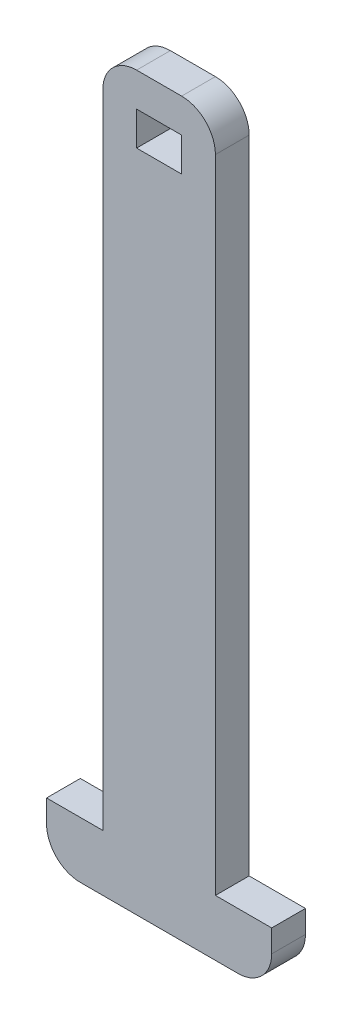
ISO-10303-21;
HEADER;
FILE_DESCRIPTION(('STEP AP214'),'2;1');
FILE_NAME('part.step','',(''),(''),'','','');
FILE_SCHEMA(('AUTOMOTIVE_DESIGN { 1 0 10303 214 1 1 1 1 }'));
ENDSEC;
DATA;
#1=APPLICATION_CONTEXT('core data for automotive mechanical design processes');
#2=APPLICATION_PROTOCOL_DEFINITION('international standard','automotive_design',2000,#1);
#3=PRODUCT_CONTEXT('',#1,'mechanical');
#4=PRODUCT('Part','Part','',(#3));
#5=PRODUCT_RELATED_PRODUCT_CATEGORY('part','',(#4));
#6=PRODUCT_DEFINITION_FORMATION('','',#4);
#7=PRODUCT_DEFINITION_CONTEXT('part definition',#1,'design');
#8=PRODUCT_DEFINITION('design','',#6,#7);
#9=PRODUCT_DEFINITION_SHAPE('','',#8);
#10=(LENGTH_UNIT() NAMED_UNIT(*) SI_UNIT(.MILLI.,.METRE.));
#11=(NAMED_UNIT(*) PLANE_ANGLE_UNIT() SI_UNIT($,.RADIAN.));
#12=(NAMED_UNIT(*) SI_UNIT($,.STERADIAN.) SOLID_ANGLE_UNIT());
#13=UNCERTAINTY_MEASURE_WITH_UNIT(LENGTH_MEASURE(1.E-05),#10,'distance_accuracy_value','');
#14=(GEOMETRIC_REPRESENTATION_CONTEXT(3) GLOBAL_UNCERTAINTY_ASSIGNED_CONTEXT((#13)) GLOBAL_UNIT_ASSIGNED_CONTEXT((#10,
#11,#12)) REPRESENTATION_CONTEXT('',''));
#15=CARTESIAN_POINT('',(0.,0.,0.));
#16=DIRECTION('',(0.,0.,1.));
#17=DIRECTION('',(1.,0.,0.));
#18=AXIS2_PLACEMENT_3D('',#15,#16,#17);
#19=CARTESIAN_POINT('',(0.,0.,3.));
#20=DIRECTION('',(0.,0.,1.));
#21=DIRECTION('',(1.,0.,0.));
#22=AXIS2_PLACEMENT_3D('',#19,#20,#21);
#23=PLANE('',#22);
#24=DIRECTION('',(0.,-1.,0.));
#25=VECTOR('',#24,1.);
#26=CARTESIAN_POINT('',(-5.,-38.8970588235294,3.));
#27=LINE('',#26,#25);
#28=CARTESIAN_POINT('',(-5.,-38.8970588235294,3.));
#29=VERTEX_POINT('',#28);
#30=CARTESIAN_POINT('',(-5.,-40.8970588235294,3.));
#31=VERTEX_POINT('',#30);
#32=EDGE_CURVE('E198',#29,#31,#27,.T.);
#33=ORIENTED_EDGE('',*,*,#32,.T.);
#34=CARTESIAN_POINT('',(-2.,-40.8970588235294,3.));
#35=DIRECTION('',(0.,0.,1.));
#36=DIRECTION('',(1.,0.,0.));
#37=AXIS2_PLACEMENT_3D('',#34,#35,#36);
#38=CIRCLE('',#37,3.);
#39=CARTESIAN_POINT('',(-2.,-43.8970588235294,3.));
#40=VERTEX_POINT('',#39);
#41=EDGE_CURVE('E258',#31,#40,#38,.T.);
#42=ORIENTED_EDGE('',*,*,#41,.T.);
#43=DIRECTION('',(1.,0.,0.));
#44=VECTOR('',#43,1.);
#45=CARTESIAN_POINT('',(-4.99999999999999,-43.8970588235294,3.));
#46=LINE('',#45,#44);
#47=CARTESIAN_POINT('',(12.,-43.8970588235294,3.));
#48=VERTEX_POINT('',#47);
#49=EDGE_CURVE('E201',#40,#48,#46,.T.);
#50=ORIENTED_EDGE('',*,*,#49,.T.);
#51=CARTESIAN_POINT('',(12.,-40.8970588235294,3.));
#52=DIRECTION('',(0.,0.,1.));
#53=DIRECTION('',(1.,0.,0.));
#54=AXIS2_PLACEMENT_3D('',#51,#52,#53);
#55=CIRCLE('',#54,3.);
#56=CARTESIAN_POINT('',(15.,-40.8970588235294,3.));
#57=VERTEX_POINT('',#56);
#58=EDGE_CURVE('E55',#48,#57,#55,.T.);
#59=ORIENTED_EDGE('',*,*,#58,.T.);
#60=DIRECTION('',(0.,1.,0.));
#61=VECTOR('',#60,1.);
#62=CARTESIAN_POINT('',(15.,-43.8970588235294,3.));
#63=LINE('',#62,#61);
#64=CARTESIAN_POINT('',(15.,-38.8970588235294,3.));
#65=VERTEX_POINT('',#64);
#66=EDGE_CURVE('E203',#57,#65,#63,.T.);
#67=ORIENTED_EDGE('',*,*,#66,.T.);
#68=DIRECTION('',(-1.,0.,0.));
#69=VECTOR('',#68,1.);
#70=CARTESIAN_POINT('',(15.,-38.8970588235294,3.));
#71=LINE('',#70,#69);
#72=CARTESIAN_POINT('',(9.99999999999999,-38.8970588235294,3.));
#73=VERTEX_POINT('',#72);
#74=EDGE_CURVE('E205',#65,#73,#71,.T.);
#75=ORIENTED_EDGE('',*,*,#74,.T.);
#76=DIRECTION('',(0.,1.,0.));
#77=VECTOR('',#76,1.);
#78=CARTESIAN_POINT('',(9.99999999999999,-38.8970588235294,3.));
#79=LINE('',#78,#77);
#80=CARTESIAN_POINT('',(9.99999999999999,18.1029411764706,3.));
#81=VERTEX_POINT('',#80);
#82=EDGE_CURVE('E207',#73,#81,#79,.T.);
#83=ORIENTED_EDGE('',*,*,#82,.T.);
#84=CARTESIAN_POINT('',(6.99999999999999,18.1029411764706,3.));
#85=DIRECTION('',(0.,0.,1.));
#86=DIRECTION('',(1.,0.,0.));
#87=AXIS2_PLACEMENT_3D('',#84,#85,#86);
#88=CIRCLE('',#87,3.);
#89=CARTESIAN_POINT('',(6.99999999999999,21.1029411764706,3.));
#90=VERTEX_POINT('',#89);
#91=EDGE_CURVE('E255',#81,#90,#88,.T.);
#92=ORIENTED_EDGE('',*,*,#91,.T.);
#93=DIRECTION('',(-1.,0.,0.));
#94=VECTOR('',#93,1.);
#95=CARTESIAN_POINT('',(9.99999999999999,21.1029411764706,3.));
#96=LINE('',#95,#94);
#97=CARTESIAN_POINT('',(2.99999999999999,21.1029411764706,3.));
#98=VERTEX_POINT('',#97);
#99=EDGE_CURVE('E190',#90,#98,#96,.T.);
#100=ORIENTED_EDGE('',*,*,#99,.T.);
#101=CARTESIAN_POINT('',(2.99999999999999,18.1029411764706,3.));
#102=DIRECTION('',(0.,0.,1.));
#103=DIRECTION('',(1.,0.,0.));
#104=AXIS2_PLACEMENT_3D('',#101,#102,#103);
#105=CIRCLE('',#104,3.);
#106=CARTESIAN_POINT('',(0.,18.1029411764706,3.));
#107=VERTEX_POINT('',#106);
#108=EDGE_CURVE('E253',#98,#107,#105,.T.);
#109=ORIENTED_EDGE('',*,*,#108,.T.);
#110=DIRECTION('',(0.,-1.,0.));
#111=VECTOR('',#110,1.);
#112=CARTESIAN_POINT('',(0.,21.1029411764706,3.));
#113=LINE('',#112,#111);
#114=CARTESIAN_POINT('',(0.,-38.8970588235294,3.));
#115=VERTEX_POINT('',#114);
#116=EDGE_CURVE('E193',#107,#115,#113,.T.);
#117=ORIENTED_EDGE('',*,*,#116,.T.);
#118=DIRECTION('',(-1.,0.,0.));
#119=VECTOR('',#118,1.);
#120=CARTESIAN_POINT('',(0.,-38.8970588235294,3.));
#121=LINE('',#120,#119);
#122=EDGE_CURVE('E196',#115,#29,#121,.T.);
#123=ORIENTED_EDGE('',*,*,#122,.T.);
#124=EDGE_LOOP('',(#33,#42,#50,#59,#67,#75,#83,#92,#100,#109,#117,#123));
#125=FACE_BOUND('',#124,.T.);
#126=DIRECTION('',(0.,-1.,0.));
#127=VECTOR('',#126,1.);
#128=CARTESIAN_POINT('',(2.99999999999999,18.1029411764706,3.));
#129=LINE('',#128,#127);
#130=CARTESIAN_POINT('',(2.99999999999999,18.1029411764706,3.));
#131=VERTEX_POINT('',#130);
#132=CARTESIAN_POINT('',(2.99999999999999,15.1029411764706,3.));
#133=VERTEX_POINT('',#132);
#134=EDGE_CURVE('E159',#131,#133,#129,.T.);
#135=ORIENTED_EDGE('',*,*,#134,.F.);
#136=DIRECTION('',(-1.,0.,0.));
#137=VECTOR('',#136,1.);
#138=CARTESIAN_POINT('',(6.99999999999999,18.1029411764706,3.));
#139=LINE('',#138,#137);
#140=CARTESIAN_POINT('',(6.99999999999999,18.1029411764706,3.));
#141=VERTEX_POINT('',#140);
#142=EDGE_CURVE('E149',#141,#131,#139,.T.);
#143=ORIENTED_EDGE('',*,*,#142,.F.);
#144=DIRECTION('',(0.,1.,0.));
#145=VECTOR('',#144,1.);
#146=CARTESIAN_POINT('',(6.99999999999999,15.1029411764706,3.));
#147=LINE('',#146,#145);
#148=CARTESIAN_POINT('',(6.99999999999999,15.1029411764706,3.));
#149=VERTEX_POINT('',#148);
#150=EDGE_CURVE('E174',#149,#141,#147,.T.);
#151=ORIENTED_EDGE('',*,*,#150,.F.);
#152=DIRECTION('',(1.,0.,0.));
#153=VECTOR('',#152,1.);
#154=CARTESIAN_POINT('',(2.99999999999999,15.1029411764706,3.));
#155=LINE('',#154,#153);
#156=EDGE_CURVE('E172',#133,#149,#155,.T.);
#157=ORIENTED_EDGE('',*,*,#156,.F.);
#158=EDGE_LOOP('',(#135,#143,#151,#157));
#159=FACE_BOUND('',#158,.T.);
#160=ADVANCED_FACE('F33',(#125,#159),#23,.T.);
#161=CARTESIAN_POINT('',(0.,0.,0.));
#162=DIRECTION('',(0.,0.,1.));
#163=DIRECTION('',(1.,0.,0.));
#164=AXIS2_PLACEMENT_3D('',#161,#162,#163);
#165=PLANE('',#164);
#166=DIRECTION('',(1.,0.,0.));
#167=VECTOR('',#166,1.);
#168=CARTESIAN_POINT('',(-4.99999999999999,-43.8970588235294,0.));
#169=LINE('',#168,#167);
#170=CARTESIAN_POINT('',(-2.,-43.8970588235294,0.));
#171=VERTEX_POINT('',#170);
#172=CARTESIAN_POINT('',(12.,-43.8970588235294,0.));
#173=VERTEX_POINT('',#172);
#174=EDGE_CURVE('E219',#171,#173,#169,.T.);
#175=ORIENTED_EDGE('',*,*,#174,.F.);
#176=CARTESIAN_POINT('',(-2.,-40.8970588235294,0.));
#177=DIRECTION('',(0.,0.,1.));
#178=DIRECTION('',(1.,0.,0.));
#179=AXIS2_PLACEMENT_3D('',#176,#177,#178);
#180=CIRCLE('',#179,3.);
#181=CARTESIAN_POINT('',(-5.,-40.8970588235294,0.));
#182=VERTEX_POINT('',#181);
#183=EDGE_CURVE('E249',#171,#182,#180,.F.);
#184=ORIENTED_EDGE('',*,*,#183,.T.);
#185=DIRECTION('',(0.,-1.,0.));
#186=VECTOR('',#185,1.);
#187=CARTESIAN_POINT('',(-5.,-38.8970588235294,0.));
#188=LINE('',#187,#186);
#189=CARTESIAN_POINT('',(-5.,-38.8970588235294,0.));
#190=VERTEX_POINT('',#189);
#191=EDGE_CURVE('E216',#190,#182,#188,.T.);
#192=ORIENTED_EDGE('',*,*,#191,.F.);
#193=DIRECTION('',(-1.,0.,0.));
#194=VECTOR('',#193,1.);
#195=CARTESIAN_POINT('',(0.,-38.8970588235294,0.));
#196=LINE('',#195,#194);
#197=CARTESIAN_POINT('',(0.,-38.8970588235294,0.));
#198=VERTEX_POINT('',#197);
#199=EDGE_CURVE('E214',#198,#190,#196,.T.);
#200=ORIENTED_EDGE('',*,*,#199,.F.);
#201=DIRECTION('',(0.,-1.,0.));
#202=VECTOR('',#201,1.);
#203=CARTESIAN_POINT('',(0.,21.1029411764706,0.));
#204=LINE('',#203,#202);
#205=CARTESIAN_POINT('',(0.,18.1029411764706,0.));
#206=VERTEX_POINT('',#205);
#207=EDGE_CURVE('E212',#206,#198,#204,.T.);
#208=ORIENTED_EDGE('',*,*,#207,.F.);
#209=CARTESIAN_POINT('',(2.99999999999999,18.1029411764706,0.));
#210=DIRECTION('',(0.,0.,1.));
#211=DIRECTION('',(1.,0.,0.));
#212=AXIS2_PLACEMENT_3D('',#209,#210,#211);
#213=CIRCLE('',#212,3.);
#214=CARTESIAN_POINT('',(2.99999999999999,21.1029411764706,0.));
#215=VERTEX_POINT('',#214);
#216=EDGE_CURVE('E243',#206,#215,#213,.F.);
#217=ORIENTED_EDGE('',*,*,#216,.T.);
#218=DIRECTION('',(-1.,0.,0.));
#219=VECTOR('',#218,1.);
#220=CARTESIAN_POINT('',(9.99999999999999,21.1029411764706,0.));
#221=LINE('',#220,#219);
#222=CARTESIAN_POINT('',(6.99999999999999,21.1029411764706,0.));
#223=VERTEX_POINT('',#222);
#224=EDGE_CURVE('E167',#223,#215,#221,.T.);
#225=ORIENTED_EDGE('',*,*,#224,.F.);
#226=CARTESIAN_POINT('',(6.99999999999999,18.1029411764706,0.));
#227=DIRECTION('',(0.,0.,1.));
#228=DIRECTION('',(1.,0.,0.));
#229=AXIS2_PLACEMENT_3D('',#226,#227,#228);
#230=CIRCLE('',#229,3.);
#231=CARTESIAN_POINT('',(9.99999999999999,18.1029411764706,0.));
#232=VERTEX_POINT('',#231);
#233=EDGE_CURVE('E245',#223,#232,#230,.F.);
#234=ORIENTED_EDGE('',*,*,#233,.T.);
#235=DIRECTION('',(0.,1.,0.));
#236=VECTOR('',#235,1.);
#237=CARTESIAN_POINT('',(9.99999999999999,-38.8970588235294,0.));
#238=LINE('',#237,#236);
#239=CARTESIAN_POINT('',(9.99999999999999,-38.8970588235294,0.));
#240=VERTEX_POINT('',#239);
#241=EDGE_CURVE('E194',#240,#232,#238,.T.);
#242=ORIENTED_EDGE('',*,*,#241,.F.);
#243=DIRECTION('',(-1.,0.,0.));
#244=VECTOR('',#243,1.);
#245=CARTESIAN_POINT('',(15.,-38.8970588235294,0.));
#246=LINE('',#245,#244);
#247=CARTESIAN_POINT('',(15.,-38.8970588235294,0.));
#248=VERTEX_POINT('',#247);
#249=EDGE_CURVE('E224',#248,#240,#246,.T.);
#250=ORIENTED_EDGE('',*,*,#249,.F.);
#251=DIRECTION('',(0.,1.,0.));
#252=VECTOR('',#251,1.);
#253=CARTESIAN_POINT('',(15.,-43.8970588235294,0.));
#254=LINE('',#253,#252);
#255=CARTESIAN_POINT('',(15.,-40.8970588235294,0.));
#256=VERTEX_POINT('',#255);
#257=EDGE_CURVE('E222',#256,#248,#254,.T.);
#258=ORIENTED_EDGE('',*,*,#257,.F.);
#259=CARTESIAN_POINT('',(12.,-40.8970588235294,0.));
#260=DIRECTION('',(0.,0.,1.));
#261=DIRECTION('',(1.,0.,0.));
#262=AXIS2_PLACEMENT_3D('',#259,#260,#261);
#263=CIRCLE('',#262,3.);
#264=EDGE_CURVE('E247',#256,#173,#263,.F.);
#265=ORIENTED_EDGE('',*,*,#264,.T.);
#266=EDGE_LOOP('',(#175,#184,#192,#200,#208,#217,#225,#234,#242,#250,#258,#265));
#267=FACE_BOUND('',#266,.T.);
#268=DIRECTION('',(-1.,0.,0.));
#269=VECTOR('',#268,1.);
#270=CARTESIAN_POINT('',(6.99999999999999,18.1029411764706,0.));
#271=LINE('',#270,#269);
#272=CARTESIAN_POINT('',(6.99999999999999,18.1029411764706,0.));
#273=VERTEX_POINT('',#272);
#274=CARTESIAN_POINT('',(2.99999999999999,18.1029411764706,0.));
#275=VERTEX_POINT('',#274);
#276=EDGE_CURVE('E178',#273,#275,#271,.T.);
#277=ORIENTED_EDGE('',*,*,#276,.T.);
#278=DIRECTION('',(0.,-1.,0.));
#279=VECTOR('',#278,1.);
#280=CARTESIAN_POINT('',(2.99999999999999,18.1029411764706,0.));
#281=LINE('',#280,#279);
#282=CARTESIAN_POINT('',(2.99999999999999,15.1029411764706,0.));
#283=VERTEX_POINT('',#282);
#284=EDGE_CURVE('E166',#275,#283,#281,.T.);
#285=ORIENTED_EDGE('',*,*,#284,.T.);
#286=DIRECTION('',(1.,0.,0.));
#287=VECTOR('',#286,1.);
#288=CARTESIAN_POINT('',(2.99999999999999,15.1029411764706,0.));
#289=LINE('',#288,#287);
#290=CARTESIAN_POINT('',(6.99999999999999,15.1029411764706,0.));
#291=VERTEX_POINT('',#290);
#292=EDGE_CURVE('E181',#283,#291,#289,.T.);
#293=ORIENTED_EDGE('',*,*,#292,.T.);
#294=DIRECTION('',(0.,1.,0.));
#295=VECTOR('',#294,1.);
#296=CARTESIAN_POINT('',(6.99999999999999,15.1029411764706,0.));
#297=LINE('',#296,#295);
#298=EDGE_CURVE('E160',#291,#273,#297,.T.);
#299=ORIENTED_EDGE('',*,*,#298,.T.);
#300=EDGE_LOOP('',(#277,#285,#293,#299));
#301=FACE_BOUND('',#300,.T.);
#302=ADVANCED_FACE('F277',(#267,#301),#165,.F.);
#303=CARTESIAN_POINT('',(9.99999999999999,21.1029411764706,3.));
#304=DIRECTION('',(0.,-1.,0.));
#305=DIRECTION('',(1.,0.,0.));
#306=AXIS2_PLACEMENT_3D('',#303,#304,#305);
#307=PLANE('',#306);
#308=ORIENTED_EDGE('',*,*,#99,.F.);
#309=DIRECTION('',(0.,0.,-1.));
#310=VECTOR('',#309,1.);
#311=CARTESIAN_POINT('',(6.99999999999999,21.1029411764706,3.));
#312=LINE('',#311,#310);
#313=EDGE_CURVE('E265',#90,#223,#312,.T.);
#314=ORIENTED_EDGE('',*,*,#313,.T.);
#315=ORIENTED_EDGE('',*,*,#224,.T.);
#316=DIRECTION('',(0.,0.,-1.));
#317=VECTOR('',#316,1.);
#318=CARTESIAN_POINT('',(2.99999999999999,21.1029411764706,3.));
#319=LINE('',#318,#317);
#320=EDGE_CURVE('E263',#215,#98,#319,.F.);
#321=ORIENTED_EDGE('',*,*,#320,.T.);
#322=EDGE_LOOP('',(#308,#314,#315,#321));
#323=FACE_BOUND('',#322,.T.);
#324=ADVANCED_FACE('F271',(#323),#307,.F.);
#325=CARTESIAN_POINT('',(0.,21.1029411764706,3.));
#326=DIRECTION('',(1.,0.,0.));
#327=DIRECTION('',(0.,1.,0.));
#328=AXIS2_PLACEMENT_3D('',#325,#326,#327);
#329=PLANE('',#328);
#330=ORIENTED_EDGE('',*,*,#116,.F.);
#331=DIRECTION('',(0.,0.,-1.));
#332=VECTOR('',#331,1.);
#333=CARTESIAN_POINT('',(0.,18.1029411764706,3.));
#334=LINE('',#333,#332);
#335=EDGE_CURVE('E11',#107,#206,#334,.T.);
#336=ORIENTED_EDGE('',*,*,#335,.T.);
#337=ORIENTED_EDGE('',*,*,#207,.T.);
#338=DIRECTION('',(0.,0.,-1.));
#339=VECTOR('',#338,1.);
#340=CARTESIAN_POINT('',(0.,-38.8970588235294,3.));
#341=LINE('',#340,#339);
#342=EDGE_CURVE('E235',#115,#198,#341,.T.);
#343=ORIENTED_EDGE('',*,*,#342,.F.);
#344=EDGE_LOOP('',(#330,#336,#337,#343));
#345=FACE_BOUND('',#344,.T.);
#346=ADVANCED_FACE('F287',(#345),#329,.F.);
#347=CARTESIAN_POINT('',(0.,-38.8970588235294,3.));
#348=DIRECTION('',(0.,-1.,0.));
#349=DIRECTION('',(0.,0.,-1.));
#350=AXIS2_PLACEMENT_3D('',#347,#348,#349);
#351=PLANE('',#350);
#352=ORIENTED_EDGE('',*,*,#199,.T.);
#353=DIRECTION('',(0.,0.,-1.));
#354=VECTOR('',#353,1.);
#355=CARTESIAN_POINT('',(-5.,-38.8970588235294,3.));
#356=LINE('',#355,#354);
#357=EDGE_CURVE('E232',#29,#190,#356,.T.);
#358=ORIENTED_EDGE('',*,*,#357,.F.);
#359=ORIENTED_EDGE('',*,*,#122,.F.);
#360=ORIENTED_EDGE('',*,*,#342,.T.);
#361=EDGE_LOOP('',(#352,#358,#359,#360));
#362=FACE_BOUND('',#361,.T.);
#363=ADVANCED_FACE('F328',(#362),#351,.F.);
#364=CARTESIAN_POINT('',(-5.,-38.8970588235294,3.));
#365=DIRECTION('',(1.,0.,0.));
#366=DIRECTION('',(0.,1.,0.));
#367=AXIS2_PLACEMENT_3D('',#364,#365,#366);
#368=PLANE('',#367);
#369=ORIENTED_EDGE('',*,*,#191,.T.);
#370=DIRECTION('',(0.,0.,-1.));
#371=VECTOR('',#370,1.);
#372=CARTESIAN_POINT('',(-5.,-40.8970588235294,3.));
#373=LINE('',#372,#371);
#374=EDGE_CURVE('E251',#182,#31,#373,.F.);
#375=ORIENTED_EDGE('',*,*,#374,.T.);
#376=ORIENTED_EDGE('',*,*,#32,.F.);
#377=ORIENTED_EDGE('',*,*,#357,.T.);
#378=EDGE_LOOP('',(#369,#375,#376,#377));
#379=FACE_BOUND('',#378,.T.);
#380=ADVANCED_FACE('F324',(#379),#368,.F.);
#381=CARTESIAN_POINT('',(-4.99999999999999,-43.8970588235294,3.));
#382=DIRECTION('',(0.,1.,0.));
#383=DIRECTION('',(0.,0.,1.));
#384=AXIS2_PLACEMENT_3D('',#381,#382,#383);
#385=PLANE('',#384);
#386=ORIENTED_EDGE('',*,*,#49,.F.);
#387=DIRECTION('',(0.,0.,-1.));
#388=VECTOR('',#387,1.);
#389=CARTESIAN_POINT('',(-2.,-43.8970588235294,3.));
#390=LINE('',#389,#388);
#391=EDGE_CURVE('E240',#40,#171,#390,.T.);
#392=ORIENTED_EDGE('',*,*,#391,.T.);
#393=ORIENTED_EDGE('',*,*,#174,.T.);
#394=DIRECTION('',(0.,0.,-1.));
#395=VECTOR('',#394,1.);
#396=CARTESIAN_POINT('',(12.,-43.8970588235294,3.));
#397=LINE('',#396,#395);
#398=EDGE_CURVE('E238',#173,#48,#397,.F.);
#399=ORIENTED_EDGE('',*,*,#398,.T.);
#400=EDGE_LOOP('',(#386,#392,#393,#399));
#401=FACE_BOUND('',#400,.T.);
#402=ADVANCED_FACE('F320',(#401),#385,.F.);
#403=CARTESIAN_POINT('',(15.,-43.8970588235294,3.));
#404=DIRECTION('',(-1.,0.,0.));
#405=DIRECTION('',(0.,0.,1.));
#406=AXIS2_PLACEMENT_3D('',#403,#404,#405);
#407=PLANE('',#406);
#408=ORIENTED_EDGE('',*,*,#66,.F.);
#409=DIRECTION('',(0.,0.,-1.));
#410=VECTOR('',#409,1.);
#411=CARTESIAN_POINT('',(15.,-40.8970588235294,3.));
#412=LINE('',#411,#410);
#413=EDGE_CURVE('E260',#57,#256,#412,.T.);
#414=ORIENTED_EDGE('',*,*,#413,.T.);
#415=ORIENTED_EDGE('',*,*,#257,.T.);
#416=DIRECTION('',(0.,0.,-1.));
#417=VECTOR('',#416,1.);
#418=CARTESIAN_POINT('',(15.,-38.8970588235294,3.));
#419=LINE('',#418,#417);
#420=EDGE_CURVE('E229',#65,#248,#419,.T.);
#421=ORIENTED_EDGE('',*,*,#420,.F.);
#422=EDGE_LOOP('',(#408,#414,#415,#421));
#423=FACE_BOUND('',#422,.T.);
#424=ADVANCED_FACE('F316',(#423),#407,.F.);
#425=CARTESIAN_POINT('',(15.,-38.8970588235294,3.));
#426=DIRECTION('',(0.,-1.,0.));
#427=DIRECTION('',(1.,0.,0.));
#428=AXIS2_PLACEMENT_3D('',#425,#426,#427);
#429=PLANE('',#428);
#430=ORIENTED_EDGE('',*,*,#249,.T.);
#431=DIRECTION('',(0.,0.,-1.));
#432=VECTOR('',#431,1.);
#433=CARTESIAN_POINT('',(9.99999999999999,-38.8970588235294,3.));
#434=LINE('',#433,#432);
#435=EDGE_CURVE('E209',#73,#240,#434,.T.);
#436=ORIENTED_EDGE('',*,*,#435,.F.);
#437=ORIENTED_EDGE('',*,*,#74,.F.);
#438=ORIENTED_EDGE('',*,*,#420,.T.);
#439=EDGE_LOOP('',(#430,#436,#437,#438));
#440=FACE_BOUND('',#439,.T.);
#441=ADVANCED_FACE('F313',(#440),#429,.F.);
#442=CARTESIAN_POINT('',(9.99999999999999,-38.8970588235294,3.));
#443=DIRECTION('',(-1.,0.,0.));
#444=DIRECTION('',(0.,0.,1.));
#445=AXIS2_PLACEMENT_3D('',#442,#443,#444);
#446=PLANE('',#445);
#447=ORIENTED_EDGE('',*,*,#241,.T.);
#448=DIRECTION('',(0.,0.,-1.));
#449=VECTOR('',#448,1.);
#450=CARTESIAN_POINT('',(9.99999999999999,18.1029411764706,3.));
#451=LINE('',#450,#449);
#452=EDGE_CURVE('E41',#232,#81,#451,.F.);
#453=ORIENTED_EDGE('',*,*,#452,.T.);
#454=ORIENTED_EDGE('',*,*,#82,.F.);
#455=ORIENTED_EDGE('',*,*,#435,.T.);
#456=EDGE_LOOP('',(#447,#453,#454,#455));
#457=FACE_BOUND('',#456,.T.);
#458=ADVANCED_FACE('F310',(#457),#446,.F.);
#459=CARTESIAN_POINT('',(6.99999999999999,18.1029411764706,3.));
#460=DIRECTION('',(0.,-1.,0.));
#461=DIRECTION('',(0.,0.,-1.));
#462=AXIS2_PLACEMENT_3D('',#459,#460,#461);
#463=PLANE('',#462);
#464=ORIENTED_EDGE('',*,*,#276,.F.);
#465=DIRECTION('',(0.,0.,-1.));
#466=VECTOR('',#465,1.);
#467=CARTESIAN_POINT('',(6.99999999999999,18.1029411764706,3.));
#468=LINE('',#467,#466);
#469=EDGE_CURVE('E155',#141,#273,#468,.T.);
#470=ORIENTED_EDGE('',*,*,#469,.F.);
#471=ORIENTED_EDGE('',*,*,#142,.T.);
#472=DIRECTION('',(0.,0.,-1.));
#473=VECTOR('',#472,1.);
#474=CARTESIAN_POINT('',(2.99999999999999,18.1029411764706,3.));
#475=LINE('',#474,#473);
#476=EDGE_CURVE('E152',#131,#275,#475,.T.);
#477=ORIENTED_EDGE('',*,*,#476,.T.);
#478=EDGE_LOOP('',(#464,#470,#471,#477));
#479=FACE_BOUND('',#478,.T.);
#480=ADVANCED_FACE('F151',(#479),#463,.T.);
#481=CARTESIAN_POINT('',(2.99999999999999,18.1029411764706,3.));
#482=DIRECTION('',(1.,0.,0.));
#483=DIRECTION('',(0.,1.,0.));
#484=AXIS2_PLACEMENT_3D('',#481,#482,#483);
#485=PLANE('',#484);
#486=ORIENTED_EDGE('',*,*,#284,.F.);
#487=ORIENTED_EDGE('',*,*,#476,.F.);
#488=ORIENTED_EDGE('',*,*,#134,.T.);
#489=DIRECTION('',(0.,0.,-1.));
#490=VECTOR('',#489,1.);
#491=CARTESIAN_POINT('',(2.99999999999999,15.1029411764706,3.));
#492=LINE('',#491,#490);
#493=EDGE_CURVE('E168',#133,#283,#492,.T.);
#494=ORIENTED_EDGE('',*,*,#493,.T.);
#495=EDGE_LOOP('',(#486,#487,#488,#494));
#496=FACE_BOUND('',#495,.T.);
#497=ADVANCED_FACE('F163',(#496),#485,.T.);
#498=CARTESIAN_POINT('',(2.99999999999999,15.1029411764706,3.));
#499=DIRECTION('',(0.,1.,0.));
#500=DIRECTION('',(-1.,0.,0.));
#501=AXIS2_PLACEMENT_3D('',#498,#499,#500);
#502=PLANE('',#501);
#503=ORIENTED_EDGE('',*,*,#292,.F.);
#504=ORIENTED_EDGE('',*,*,#493,.F.);
#505=ORIENTED_EDGE('',*,*,#156,.T.);
#506=DIRECTION('',(0.,0.,-1.));
#507=VECTOR('',#506,1.);
#508=CARTESIAN_POINT('',(6.99999999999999,15.1029411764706,3.));
#509=LINE('',#508,#507);
#510=EDGE_CURVE('E187',#149,#291,#509,.T.);
#511=ORIENTED_EDGE('',*,*,#510,.T.);
#512=EDGE_LOOP('',(#503,#504,#505,#511));
#513=FACE_BOUND('',#512,.T.);
#514=ADVANCED_FACE('F343',(#513),#502,.T.);
#515=CARTESIAN_POINT('',(6.99999999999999,15.1029411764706,3.));
#516=DIRECTION('',(-1.,0.,0.));
#517=DIRECTION('',(0.,0.,1.));
#518=AXIS2_PLACEMENT_3D('',#515,#516,#517);
#519=PLANE('',#518);
#520=ORIENTED_EDGE('',*,*,#298,.F.);
#521=ORIENTED_EDGE('',*,*,#510,.F.);
#522=ORIENTED_EDGE('',*,*,#150,.T.);
#523=ORIENTED_EDGE('',*,*,#469,.T.);
#524=EDGE_LOOP('',(#520,#521,#522,#523));
#525=FACE_BOUND('',#524,.T.);
#526=ADVANCED_FACE('F338',(#525),#519,.T.);
#527=CARTESIAN_POINT('',(-2.,-40.8970588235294,3.));
#528=DIRECTION('',(0.,0.,-1.));
#529=DIRECTION('',(-1.,0.,0.));
#530=AXIS2_PLACEMENT_3D('',#527,#528,#529);
#531=CYLINDRICAL_SURFACE('',#530,3.);
#532=ORIENTED_EDGE('',*,*,#41,.F.);
#533=ORIENTED_EDGE('',*,*,#374,.F.);
#534=ORIENTED_EDGE('',*,*,#183,.F.);
#535=ORIENTED_EDGE('',*,*,#391,.F.);
#536=EDGE_LOOP('',(#532,#533,#534,#535));
#537=FACE_BOUND('',#536,.T.);
#538=ADVANCED_FACE('F298',(#537),#531,.T.);
#539=CARTESIAN_POINT('',(12.,-40.8970588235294,3.));
#540=DIRECTION('',(0.,0.,-1.));
#541=DIRECTION('',(-1.,0.,0.));
#542=AXIS2_PLACEMENT_3D('',#539,#540,#541);
#543=CYLINDRICAL_SURFACE('',#542,3.);
#544=ORIENTED_EDGE('',*,*,#58,.F.);
#545=ORIENTED_EDGE('',*,*,#398,.F.);
#546=ORIENTED_EDGE('',*,*,#264,.F.);
#547=ORIENTED_EDGE('',*,*,#413,.F.);
#548=EDGE_LOOP('',(#544,#545,#546,#547));
#549=FACE_BOUND('',#548,.T.);
#550=ADVANCED_FACE('F293',(#549),#543,.T.);
#551=CARTESIAN_POINT('',(6.99999999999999,18.1029411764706,3.));
#552=DIRECTION('',(0.,0.,-1.));
#553=DIRECTION('',(-1.,0.,0.));
#554=AXIS2_PLACEMENT_3D('',#551,#552,#553);
#555=CYLINDRICAL_SURFACE('',#554,3.);
#556=ORIENTED_EDGE('',*,*,#91,.F.);
#557=ORIENTED_EDGE('',*,*,#452,.F.);
#558=ORIENTED_EDGE('',*,*,#233,.F.);
#559=ORIENTED_EDGE('',*,*,#313,.F.);
#560=EDGE_LOOP('',(#556,#557,#558,#559));
#561=FACE_BOUND('',#560,.T.);
#562=ADVANCED_FACE('F291',(#561),#555,.T.);
#563=CARTESIAN_POINT('',(2.99999999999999,18.1029411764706,3.));
#564=DIRECTION('',(0.,0.,-1.));
#565=DIRECTION('',(-1.,0.,0.));
#566=AXIS2_PLACEMENT_3D('',#563,#564,#565);
#567=CYLINDRICAL_SURFACE('',#566,3.);
#568=ORIENTED_EDGE('',*,*,#108,.F.);
#569=ORIENTED_EDGE('',*,*,#320,.F.);
#570=ORIENTED_EDGE('',*,*,#216,.F.);
#571=ORIENTED_EDGE('',*,*,#335,.F.);
#572=EDGE_LOOP('',(#568,#569,#570,#571));
#573=FACE_BOUND('',#572,.T.);
#574=ADVANCED_FACE('F35',(#573),#567,.T.);
#575=CLOSED_SHELL('',(#160,#302,#324,#346,#363,#380,#402,#424,#441,#458,#480,#497,#514,#526,
#538,#550,#562,#574));
#576=MANIFOLD_SOLID_BREP('B2',#575);
#577=ADVANCED_BREP_SHAPE_REPRESENTATION('',(#18,#576),#14);
#578=SHAPE_DEFINITION_REPRESENTATION(#9,#577);
ENDSEC;
END-ISO-10303-21;
